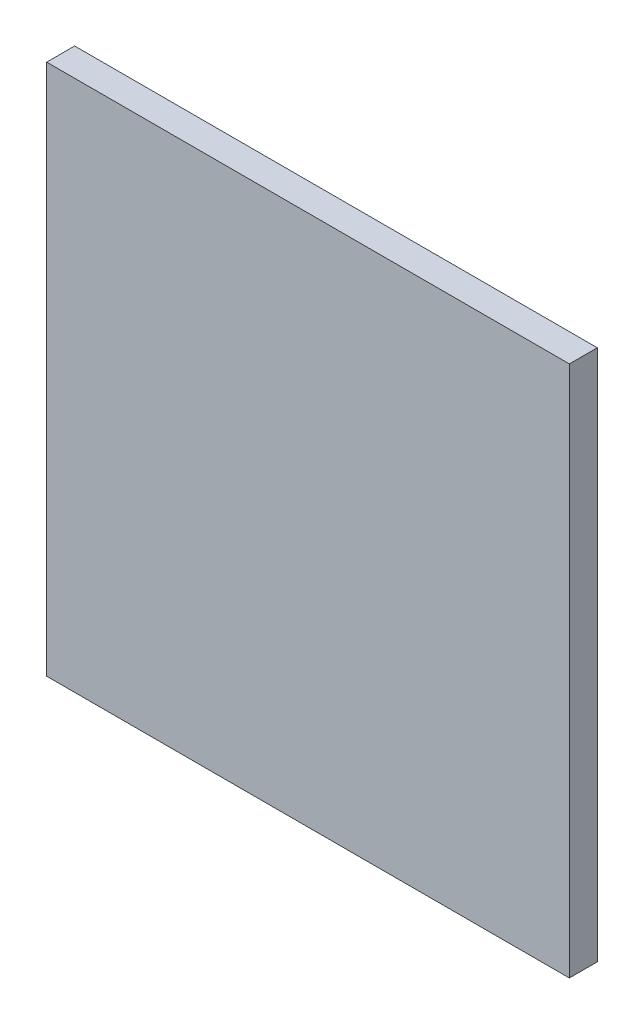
ISO-10303-21;
HEADER;
FILE_DESCRIPTION(('STEP AP214'),'2;1');
FILE_NAME('part.step','',(''),(''),'','','');
FILE_SCHEMA(('AUTOMOTIVE_DESIGN { 1 0 10303 214 1 1 1 1 }'));
ENDSEC;
DATA;
#1=APPLICATION_CONTEXT('core data for automotive mechanical design processes');
#2=APPLICATION_PROTOCOL_DEFINITION('international standard','automotive_design',2000,#1);
#3=PRODUCT_CONTEXT('',#1,'mechanical');
#4=PRODUCT('Part','Part','',(#3));
#5=PRODUCT_RELATED_PRODUCT_CATEGORY('part','',(#4));
#6=PRODUCT_DEFINITION_FORMATION('','',#4);
#7=PRODUCT_DEFINITION_CONTEXT('part definition',#1,'design');
#8=PRODUCT_DEFINITION('design','',#6,#7);
#9=PRODUCT_DEFINITION_SHAPE('','',#8);
#10=(LENGTH_UNIT() NAMED_UNIT(*) SI_UNIT(.MILLI.,.METRE.));
#11=(NAMED_UNIT(*) PLANE_ANGLE_UNIT() SI_UNIT($,.RADIAN.));
#12=(NAMED_UNIT(*) SI_UNIT($,.STERADIAN.) SOLID_ANGLE_UNIT());
#13=UNCERTAINTY_MEASURE_WITH_UNIT(LENGTH_MEASURE(1.E-05),#10,'distance_accuracy_value','');
#14=(GEOMETRIC_REPRESENTATION_CONTEXT(3) GLOBAL_UNCERTAINTY_ASSIGNED_CONTEXT((#13)) GLOBAL_UNIT_ASSIGNED_CONTEXT((#10,
#11,#12)) REPRESENTATION_CONTEXT('',''));
#15=CARTESIAN_POINT('',(0.,0.,0.));
#16=DIRECTION('',(0.,0.,1.));
#17=DIRECTION('',(1.,0.,0.));
#18=AXIS2_PLACEMENT_3D('',#15,#16,#17);
#19=CARTESIAN_POINT('',(3.2,18.89,-0.03048));
#20=DIRECTION('',(0.,-1.,0.));
#21=DIRECTION('',(0.,0.,-1.));
#22=AXIS2_PLACEMENT_3D('',#19,#20,#21);
#23=PLANE('',#22);
#24=DIRECTION('',(1.,0.,0.));
#25=VECTOR('',#24,1.);
#26=CARTESIAN_POINT('',(3.485,18.89,0.));
#27=LINE('',#26,#25);
#28=CARTESIAN_POINT('',(3.2,18.89,0.));
#29=VERTEX_POINT('',#28);
#30=CARTESIAN_POINT('',(3.77,18.89,0.));
#31=VERTEX_POINT('',#30);
#32=EDGE_CURVE('E73',#29,#31,#27,.T.);
#33=ORIENTED_EDGE('',*,*,#32,.T.);
#34=DIRECTION('',(0.,0.,-1.));
#35=VECTOR('',#34,1.);
#36=CARTESIAN_POINT('',(3.77,18.89,-0.01524));
#37=LINE('',#36,#35);
#38=CARTESIAN_POINT('',(3.77,18.89,-0.03048));
#39=VERTEX_POINT('',#38);
#40=EDGE_CURVE('E97',#31,#39,#37,.T.);
#41=ORIENTED_EDGE('',*,*,#40,.T.);
#42=DIRECTION('',(1.,0.,0.));
#43=VECTOR('',#42,1.);
#44=CARTESIAN_POINT('',(3.2,18.89,-0.03048));
#45=LINE('',#44,#43);
#46=CARTESIAN_POINT('',(3.2,18.89,-0.03048));
#47=VERTEX_POINT('',#46);
#48=EDGE_CURVE('E75',#47,#39,#45,.T.);
#49=ORIENTED_EDGE('',*,*,#48,.F.);
#50=DIRECTION('',(0.,0.,-1.));
#51=VECTOR('',#50,1.);
#52=CARTESIAN_POINT('',(3.2,18.89,-0.01524));
#53=LINE('',#52,#51);
#54=EDGE_CURVE('E11',#29,#47,#53,.T.);
#55=ORIENTED_EDGE('',*,*,#54,.F.);
#56=EDGE_LOOP('',(#33,#41,#49,#55));
#57=FACE_BOUND('',#56,.T.);
#58=ADVANCED_FACE('F17',(#57),#23,.F.);
#59=CARTESIAN_POINT('',(3.2,18.31,-0.03048));
#60=DIRECTION('',(1.,0.,0.));
#61=DIRECTION('',(0.,1.,0.));
#62=AXIS2_PLACEMENT_3D('',#59,#60,#61);
#63=PLANE('',#62);
#64=DIRECTION('',(0.,1.,0.));
#65=VECTOR('',#64,1.);
#66=CARTESIAN_POINT('',(3.2,18.6,0.));
#67=LINE('',#66,#65);
#68=CARTESIAN_POINT('',(3.2,18.31,0.));
#69=VERTEX_POINT('',#68);
#70=EDGE_CURVE('E79',#69,#29,#67,.T.);
#71=ORIENTED_EDGE('',*,*,#70,.T.);
#72=ORIENTED_EDGE('',*,*,#54,.T.);
#73=DIRECTION('',(0.,1.,0.));
#74=VECTOR('',#73,1.);
#75=CARTESIAN_POINT('',(3.2,18.31,-0.03048));
#76=LINE('',#75,#74);
#77=CARTESIAN_POINT('',(3.2,18.31,-0.03048));
#78=VERTEX_POINT('',#77);
#79=EDGE_CURVE('E98',#78,#47,#76,.T.);
#80=ORIENTED_EDGE('',*,*,#79,.F.);
#81=DIRECTION('',(0.,0.,-1.));
#82=VECTOR('',#81,1.);
#83=CARTESIAN_POINT('',(3.2,18.31,-0.01524));
#84=LINE('',#83,#82);
#85=EDGE_CURVE('E25',#69,#78,#84,.T.);
#86=ORIENTED_EDGE('',*,*,#85,.F.);
#87=EDGE_LOOP('',(#71,#72,#80,#86));
#88=FACE_BOUND('',#87,.T.);
#89=ADVANCED_FACE('F80',(#88),#63,.F.);
#90=CARTESIAN_POINT('',(3.77,18.31,-0.03048));
#91=DIRECTION('',(0.,1.,0.));
#92=DIRECTION('',(1.,0.,0.));
#93=AXIS2_PLACEMENT_3D('',#90,#91,#92);
#94=PLANE('',#93);
#95=DIRECTION('',(-1.,0.,0.));
#96=VECTOR('',#95,1.);
#97=CARTESIAN_POINT('',(3.485,18.31,0.));
#98=LINE('',#97,#96);
#99=CARTESIAN_POINT('',(3.77,18.31,0.));
#100=VERTEX_POINT('',#99);
#101=EDGE_CURVE('E84',#100,#69,#98,.T.);
#102=ORIENTED_EDGE('',*,*,#101,.T.);
#103=ORIENTED_EDGE('',*,*,#85,.T.);
#104=DIRECTION('',(-1.,0.,0.));
#105=VECTOR('',#104,1.);
#106=CARTESIAN_POINT('',(3.77,18.31,-0.03048));
#107=LINE('',#106,#105);
#108=CARTESIAN_POINT('',(3.77,18.31,-0.03048));
#109=VERTEX_POINT('',#108);
#110=EDGE_CURVE('E104',#109,#78,#107,.T.);
#111=ORIENTED_EDGE('',*,*,#110,.F.);
#112=DIRECTION('',(0.,0.,-1.));
#113=VECTOR('',#112,1.);
#114=CARTESIAN_POINT('',(3.77,18.31,-0.01524));
#115=LINE('',#114,#113);
#116=EDGE_CURVE('E46',#100,#109,#115,.T.);
#117=ORIENTED_EDGE('',*,*,#116,.F.);
#118=EDGE_LOOP('',(#102,#103,#111,#117));
#119=FACE_BOUND('',#118,.T.);
#120=ADVANCED_FACE('F138',(#119),#94,.F.);
#121=CARTESIAN_POINT('',(3.77,18.89,-0.03048));
#122=DIRECTION('',(-1.,0.,0.));
#123=DIRECTION('',(0.,0.,1.));
#124=AXIS2_PLACEMENT_3D('',#121,#122,#123);
#125=PLANE('',#124);
#126=DIRECTION('',(0.,-1.,0.));
#127=VECTOR('',#126,1.);
#128=CARTESIAN_POINT('',(3.77,18.6,0.));
#129=LINE('',#128,#127);
#130=EDGE_CURVE('E88',#31,#100,#129,.T.);
#131=ORIENTED_EDGE('',*,*,#130,.T.);
#132=ORIENTED_EDGE('',*,*,#116,.T.);
#133=DIRECTION('',(0.,-1.,0.));
#134=VECTOR('',#133,1.);
#135=CARTESIAN_POINT('',(3.77,18.89,-0.03048));
#136=LINE('',#135,#134);
#137=EDGE_CURVE('E100',#39,#109,#136,.T.);
#138=ORIENTED_EDGE('',*,*,#137,.F.);
#139=ORIENTED_EDGE('',*,*,#40,.F.);
#140=EDGE_LOOP('',(#131,#132,#138,#139));
#141=FACE_BOUND('',#140,.T.);
#142=ADVANCED_FACE('F132',(#141),#125,.F.);
#143=CARTESIAN_POINT('',(3.485,18.6,-0.03048));
#144=DIRECTION('',(0.,0.,1.));
#145=DIRECTION('',(1.,0.,0.));
#146=AXIS2_PLACEMENT_3D('',#143,#144,#145);
#147=PLANE('',#146);
#148=ORIENTED_EDGE('',*,*,#48,.T.);
#149=ORIENTED_EDGE('',*,*,#137,.T.);
#150=ORIENTED_EDGE('',*,*,#110,.T.);
#151=ORIENTED_EDGE('',*,*,#79,.T.);
#152=EDGE_LOOP('',(#148,#149,#150,#151));
#153=FACE_BOUND('',#152,.T.);
#154=ADVANCED_FACE('F123',(#153),#147,.F.);
#155=CARTESIAN_POINT('',(3.485,18.6,0.));
#156=DIRECTION('',(0.,0.,1.));
#157=DIRECTION('',(1.,0.,0.));
#158=AXIS2_PLACEMENT_3D('',#155,#156,#157);
#159=PLANE('',#158);
#160=ORIENTED_EDGE('',*,*,#32,.F.);
#161=ORIENTED_EDGE('',*,*,#70,.F.);
#162=ORIENTED_EDGE('',*,*,#101,.F.);
#163=ORIENTED_EDGE('',*,*,#130,.F.);
#164=EDGE_LOOP('',(#160,#161,#162,#163));
#165=FACE_BOUND('',#164,.T.);
#166=ADVANCED_FACE('F87',(#165),#159,.T.);
#167=CLOSED_SHELL('',(#58,#89,#120,#142,#154,#166));
#168=MANIFOLD_SOLID_BREP('B1',#167);
#169=ADVANCED_BREP_SHAPE_REPRESENTATION('',(#18,#168),#14);
#170=SHAPE_DEFINITION_REPRESENTATION(#9,#169);
ENDSEC;
END-ISO-10303-21;
